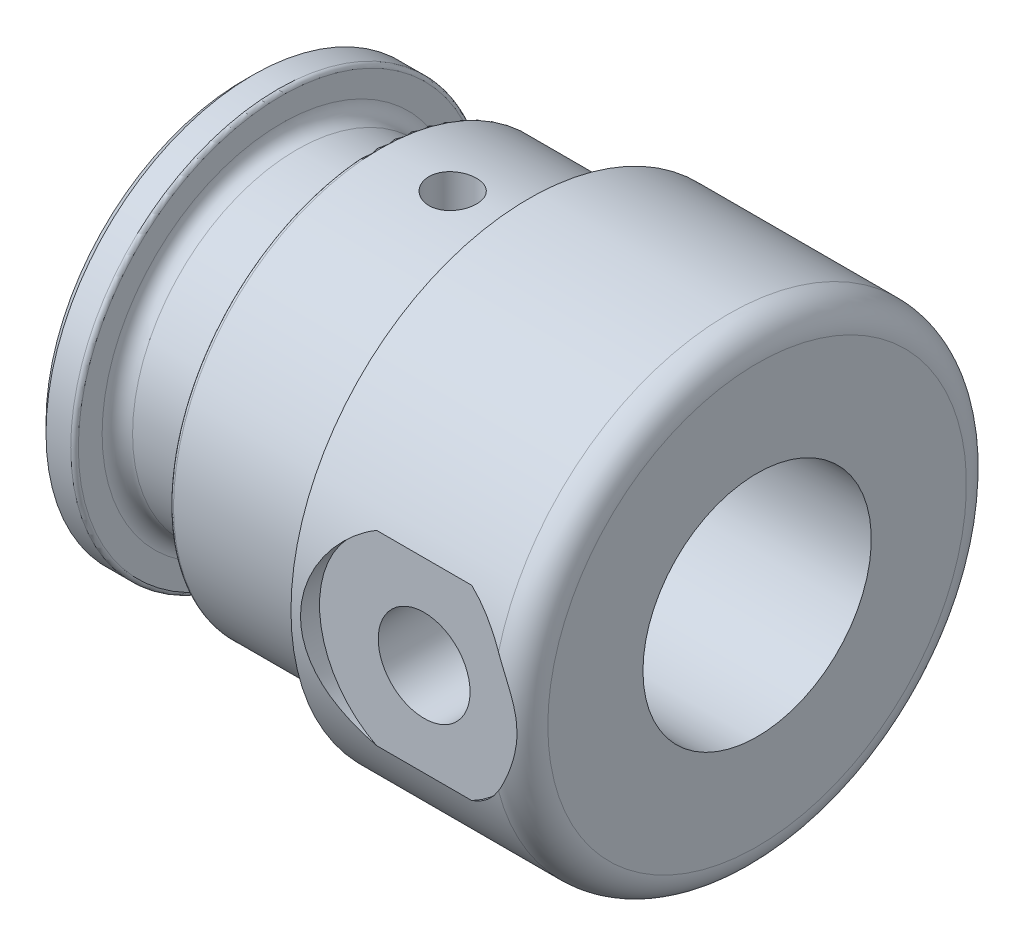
ISO-10303-21;
HEADER;
FILE_DESCRIPTION(('STEP AP214'),'2;1');
FILE_NAME('part.step','',(''),(''),'','','');
FILE_SCHEMA(('AUTOMOTIVE_DESIGN { 1 0 10303 214 1 1 1 1 }'));
ENDSEC;
DATA;
#1=APPLICATION_CONTEXT('core data for automotive mechanical design processes');
#2=APPLICATION_PROTOCOL_DEFINITION('international standard','automotive_design',2000,#1);
#3=PRODUCT_CONTEXT('',#1,'mechanical');
#4=PRODUCT('Part','Part','',(#3));
#5=PRODUCT_RELATED_PRODUCT_CATEGORY('part','',(#4));
#6=PRODUCT_DEFINITION_FORMATION('','',#4);
#7=PRODUCT_DEFINITION_CONTEXT('part definition',#1,'design');
#8=PRODUCT_DEFINITION('design','',#6,#7);
#9=PRODUCT_DEFINITION_SHAPE('','',#8);
#10=(LENGTH_UNIT() NAMED_UNIT(*) SI_UNIT(.MILLI.,.METRE.));
#11=(NAMED_UNIT(*) PLANE_ANGLE_UNIT() SI_UNIT($,.RADIAN.));
#12=(NAMED_UNIT(*) SI_UNIT($,.STERADIAN.) SOLID_ANGLE_UNIT());
#13=UNCERTAINTY_MEASURE_WITH_UNIT(LENGTH_MEASURE(1.E-05),#10,'distance_accuracy_value','');
#14=(GEOMETRIC_REPRESENTATION_CONTEXT(3) GLOBAL_UNCERTAINTY_ASSIGNED_CONTEXT((#13)) GLOBAL_UNIT_ASSIGNED_CONTEXT((#10,
#11,#12)) REPRESENTATION_CONTEXT('',''));
#15=CARTESIAN_POINT('',(0.,0.,0.));
#16=DIRECTION('',(0.,0.,1.));
#17=DIRECTION('',(1.,0.,0.));
#18=AXIS2_PLACEMENT_3D('',#15,#16,#17);
#19=CARTESIAN_POINT('',(0.,0.,0.));
#20=DIRECTION('',(-1.00000000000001,0.,0.));
#21=DIRECTION('',(0.,0.,1.));
#22=AXIS2_PLACEMENT_3D('',#19,#20,#21);
#23=CYLINDRICAL_SURFACE('',#22,10.875);
#24=CARTESIAN_POINT('',(1.8,0.,0.));
#25=DIRECTION('',(-1.00000000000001,0.,0.));
#26=DIRECTION('',(0.,0.,1.));
#27=AXIS2_PLACEMENT_3D('',#24,#25,#26);
#28=CIRCLE('',#27,10.875);
#29=CARTESIAN_POINT('',(1.8,0.,10.875));
#30=VERTEX_POINT('',#29);
#31=EDGE_CURVE('E168',#30,#30,#28,.T.);
#32=ORIENTED_EDGE('',*,*,#31,.T.);
#33=EDGE_LOOP('',(#32));
#34=FACE_BOUND('',#33,.T.);
#35=CARTESIAN_POINT('',(0.5,0.,0.));
#36=DIRECTION('',(1.00000000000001,0.,0.));
#37=DIRECTION('',(0.,0.,-1.));
#38=AXIS2_PLACEMENT_3D('',#35,#36,#37);
#39=CIRCLE('',#38,10.875);
#40=CARTESIAN_POINT('',(0.5,0.,-10.875));
#41=VERTEX_POINT('',#40);
#42=EDGE_CURVE('E171',#41,#41,#39,.T.);
#43=ORIENTED_EDGE('',*,*,#42,.T.);
#44=EDGE_LOOP('',(#43));
#45=FACE_BOUND('',#44,.T.);
#46=ADVANCED_FACE('F40',(#34,#45),#23,.T.);
#47=CARTESIAN_POINT('',(0.,5.55625000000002,0.));
#48=DIRECTION('',(1.00000000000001,0.,0.));
#49=DIRECTION('',(0.,0.,-1.));
#50=AXIS2_PLACEMENT_3D('',#47,#48,#49);
#51=PLANE('',#50);
#52=CARTESIAN_POINT('',(0.,0.,0.));
#53=DIRECTION('',(-1.00000000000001,0.,0.));
#54=DIRECTION('',(0.,0.,1.));
#55=AXIS2_PLACEMENT_3D('',#52,#53,#54);
#56=CIRCLE('',#55,6.);
#57=CARTESIAN_POINT('',(0.,0.,6.));
#58=VERTEX_POINT('',#57);
#59=EDGE_CURVE('E98',#58,#58,#56,.T.);
#60=ORIENTED_EDGE('',*,*,#59,.F.);
#61=EDGE_LOOP('',(#60));
#62=FACE_BOUND('',#61,.T.);
#63=CARTESIAN_POINT('',(0.,0.,0.));
#64=DIRECTION('',(1.00000000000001,0.,0.));
#65=DIRECTION('',(0.,0.,-1.));
#66=AXIS2_PLACEMENT_3D('',#63,#64,#65);
#67=CIRCLE('',#66,10.375);
#68=CARTESIAN_POINT('',(0.,0.,-10.375));
#69=VERTEX_POINT('',#68);
#70=EDGE_CURVE('E174',#69,#69,#67,.F.);
#71=ORIENTED_EDGE('',*,*,#70,.T.);
#72=EDGE_LOOP('',(#71));
#73=FACE_BOUND('',#72,.T.);
#74=ADVANCED_FACE('F158',(#62,#73),#51,.F.);
#75=CARTESIAN_POINT('',(27.0000000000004,12.5000000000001,0.));
#76=DIRECTION('',(-1.00000000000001,0.,0.));
#77=DIRECTION('',(0.,0.,1.));
#78=AXIS2_PLACEMENT_3D('',#75,#76,#77);
#79=PLANE('',#78);
#80=CARTESIAN_POINT('',(27.0000000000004,0.,0.));
#81=DIRECTION('',(-1.00000000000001,0.,0.));
#82=DIRECTION('',(0.,0.,1.));
#83=AXIS2_PLACEMENT_3D('',#80,#81,#82);
#84=CIRCLE('',#83,6.);
#85=CARTESIAN_POINT('',(27.0000000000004,0.,6.));
#86=VERTEX_POINT('',#85);
#87=EDGE_CURVE('E101',#86,#86,#84,.T.);
#88=ORIENTED_EDGE('',*,*,#87,.T.);
#89=EDGE_LOOP('',(#88));
#90=FACE_BOUND('',#89,.T.);
#91=CARTESIAN_POINT('',(27.0000000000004,0.,0.));
#92=DIRECTION('',(-1.00000000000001,0.,0.));
#93=DIRECTION('',(0.,0.,1.));
#94=AXIS2_PLACEMENT_3D('',#91,#92,#93);
#95=CIRCLE('',#94,11.);
#96=CARTESIAN_POINT('',(27.0000000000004,0.,11.));
#97=VERTEX_POINT('',#96);
#98=EDGE_CURVE('E176',#97,#97,#95,.F.);
#99=ORIENTED_EDGE('',*,*,#98,.T.);
#100=EDGE_LOOP('',(#99));
#101=FACE_BOUND('',#100,.T.);
#102=ADVANCED_FACE('F163',(#90,#101),#79,.F.);
#103=CARTESIAN_POINT('',(0.,0.,0.));
#104=DIRECTION('',(-1.00000000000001,0.,0.));
#105=DIRECTION('',(0.,0.,1.));
#106=AXIS2_PLACEMENT_3D('',#103,#104,#105);
#107=CYLINDRICAL_SURFACE('',#106,12.5);
#108=DIRECTION('',(-1.00000000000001,0.,0.));
#109=VECTOR('',#108,1.);
#110=CARTESIAN_POINT('',(0.,4.89897948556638,11.5));
#111=LINE('',#110,#109);
#112=CARTESIAN_POINT('',(23.5000000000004,4.89897948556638,11.5));
#113=VERTEX_POINT('',#112);
#114=CARTESIAN_POINT('',(18.5000000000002,4.89897948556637,11.5));
#115=VERTEX_POINT('',#114);
#116=EDGE_CURVE('E11',#113,#115,#111,.T.);
#117=ORIENTED_EDGE('',*,*,#116,.F.);
#118=CARTESIAN_POINT('',(23.5000000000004,4.89897948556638,11.5));
#119=CARTESIAN_POINT('',(23.6424948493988,4.82626980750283,11.5309719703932));
#120=CARTESIAN_POINT('',(23.7814813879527,4.74750164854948,11.5637153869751));
#121=CARTESIAN_POINT('',(24.0517004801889,4.57848297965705,11.6316723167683));
#122=CARTESIAN_POINT('',(24.1829312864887,4.4882298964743,11.6668863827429));
#123=CARTESIAN_POINT('',(24.4343670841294,4.2987702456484,11.7379984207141));
#124=CARTESIAN_POINT('',(24.5547369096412,4.1997720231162,11.7738697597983));
#125=CARTESIAN_POINT('',(24.7865487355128,3.99202418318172,11.8459201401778));
#126=CARTESIAN_POINT('',(24.8979948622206,3.88327912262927,11.8820990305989));
#127=CARTESIAN_POINT('',(25.0938189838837,3.67526342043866,11.9478992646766));
#128=CARTESIAN_POINT('',(25.1796351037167,3.57737367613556,11.9776209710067));
#129=CARTESIAN_POINT('',(25.3449256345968,3.37473862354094,12.0362944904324));
#130=CARTESIAN_POINT('',(25.4243416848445,3.26994328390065,12.065237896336));
#131=CARTESIAN_POINT('',(25.5000000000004,3.1622776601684,12.0933866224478));
#132=B_SPLINE_CURVE_WITH_KNOTS('',3,(#118,#119,#120,#121,#122,#123,#124,#125,#126,#127,#128,
#129,#130,#131),.UNSPECIFIED.,.F.,.F.,(4,2,2,2,2,2,4),(0.,0.48863502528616,0.977379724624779,
1.45661610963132,1.93562959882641,2.33590420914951,2.73949144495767),.UNSPECIFIED.);
#133=CARTESIAN_POINT('',(25.5000000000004,3.1622776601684,12.0933866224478));
#134=VERTEX_POINT('',#133);
#135=EDGE_CURVE('E75',#113,#134,#132,.T.);
#136=ORIENTED_EDGE('',*,*,#135,.T.);
#137=CARTESIAN_POINT('',(25.5000000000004,0.,0.));
#138=DIRECTION('',(-1.00000000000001,0.,0.));
#139=DIRECTION('',(0.,0.,1.));
#140=AXIS2_PLACEMENT_3D('',#137,#138,#139);
#141=CIRCLE('',#140,12.5);
#142=CARTESIAN_POINT('',(25.5000000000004,-3.1622776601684,12.0933866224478));
#143=VERTEX_POINT('',#142);
#144=EDGE_CURVE('E173',#134,#143,#141,.T.);
#145=ORIENTED_EDGE('',*,*,#144,.T.);
#146=CARTESIAN_POINT('',(25.5000000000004,-3.1622776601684,12.0933866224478));
#147=CARTESIAN_POINT('',(25.4083952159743,-3.29264212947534,12.0593080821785));
#148=CARTESIAN_POINT('',(25.3112708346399,-3.41880304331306,12.0240563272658));
#149=CARTESIAN_POINT('',(25.1066317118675,-3.66208084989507,11.9522044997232));
#150=CARTESIAN_POINT('',(24.9991126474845,-3.77919394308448,11.9156038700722));
#151=CARTESIAN_POINT('',(24.7766156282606,-4.00142680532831,11.8428040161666));
#152=CARTESIAN_POINT('',(24.661825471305,-4.10673684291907,11.8066110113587));
#153=CARTESIAN_POINT('',(24.4236589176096,-4.30729375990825,11.734928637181));
#154=CARTESIAN_POINT('',(24.3002870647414,-4.40254589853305,11.6994389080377));
#155=CARTESIAN_POINT('',(24.0665408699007,-4.56763576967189,11.6358581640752));
#156=CARTESIAN_POINT('',(23.9573653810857,-4.6390769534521,11.6075101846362));
#157=CARTESIAN_POINT('',(23.7329533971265,-4.77475720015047,11.5523630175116));
#158=CARTESIAN_POINT('',(23.6176739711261,-4.83893127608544,11.5255787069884));
#159=CARTESIAN_POINT('',(23.5000000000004,-4.89897948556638,11.5));
#160=B_SPLINE_CURVE_WITH_KNOTS('',3,(#146,#147,#148,#149,#150,#151,#152,#153,#154,#155,#156,
#157,#158,#159),.UNSPECIFIED.,.F.,.F.,(4,2,2,2,2,2,4),(0.,0.488634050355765,0.977472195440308,
1.45671659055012,1.93570913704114,2.33593396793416,2.73949439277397),.UNSPECIFIED.);
#161=CARTESIAN_POINT('',(23.5000000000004,-4.89897948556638,11.5));
#162=VERTEX_POINT('',#161);
#163=EDGE_CURVE('E54',#143,#162,#160,.T.);
#164=ORIENTED_EDGE('',*,*,#163,.T.);
#165=DIRECTION('',(-1.00000000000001,0.,0.));
#166=VECTOR('',#165,1.);
#167=CARTESIAN_POINT('',(0.,-4.89897948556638,11.5));
#168=LINE('',#167,#166);
#169=CARTESIAN_POINT('',(18.5000000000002,-4.8989794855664,11.5));
#170=VERTEX_POINT('',#169);
#171=EDGE_CURVE('E47',#170,#162,#168,.F.);
#172=ORIENTED_EDGE('',*,*,#171,.F.);
#173=CARTESIAN_POINT('',(18.5000000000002,-4.8989794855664,11.5));
#174=CARTESIAN_POINT('',(18.3589289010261,-4.82698356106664,11.5306652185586));
#175=CARTESIAN_POINT('',(18.2213464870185,-4.74909801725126,11.5630505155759));
#176=CARTESIAN_POINT('',(17.9538314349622,-4.5821102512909,11.6302362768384));
#177=CARTESIAN_POINT('',(17.8238969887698,-4.49301069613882,11.6650361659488));
#178=CARTESIAN_POINT('',(17.4464386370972,-4.20965109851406,11.7715548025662));
#179=CARTESIAN_POINT('',(17.2113014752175,-3.99935156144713,11.8453829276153));
#180=CARTESIAN_POINT('',(16.7799521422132,-3.54120421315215,11.9903049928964));
#181=CARTESIAN_POINT('',(16.5837363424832,-3.2933599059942,12.0613991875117));
#182=CARTESIAN_POINT('',(16.3227592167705,-2.89800310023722,12.1601870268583));
#183=CARTESIAN_POINT('',(16.2413055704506,-2.76224240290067,12.1918155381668));
#184=CARTESIAN_POINT('',(16.0901456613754,-2.48362880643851,12.25160556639));
#185=CARTESIAN_POINT('',(16.020434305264,-2.34077901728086,12.2797685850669));
#186=CARTESIAN_POINT('',(15.8944336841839,-2.05127274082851,12.3314054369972));
#187=CARTESIAN_POINT('',(15.8379464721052,-1.90471451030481,12.3549474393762));
#188=CARTESIAN_POINT('',(15.737576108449,-1.6067339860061,12.3972187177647));
#189=CARTESIAN_POINT('',(15.693687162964,-1.45531396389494,12.4159502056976));
#190=CARTESIAN_POINT('',(15.6189901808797,-1.14874718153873,12.4480572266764));
#191=CARTESIAN_POINT('',(15.5881799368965,-0.993601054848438,12.4614336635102));
#192=CARTESIAN_POINT('',(15.5400122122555,-0.680852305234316,12.4824274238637));
#193=CARTESIAN_POINT('',(15.5226536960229,-0.523249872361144,12.4900451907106));
#194=CARTESIAN_POINT('',(15.5024486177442,-0.219568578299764,12.4989199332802));
#195=CARTESIAN_POINT('',(15.4985563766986,-0.0735716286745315,12.5006351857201));
#196=CARTESIAN_POINT('',(15.502395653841,0.218291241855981,12.4989459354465));
#197=CARTESIAN_POINT('',(15.5101310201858,0.364157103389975,12.495539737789));
#198=CARTESIAN_POINT('',(15.5371395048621,0.654526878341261,12.4836972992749));
#199=CARTESIAN_POINT('',(15.5564063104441,0.799031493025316,12.4752638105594));
#200=CARTESIAN_POINT('',(15.6062705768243,1.08575702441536,12.4535863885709));
#201=CARTESIAN_POINT('',(15.636872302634,1.22797706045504,12.4403406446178));
#202=CARTESIAN_POINT('',(15.7081985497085,1.50560997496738,12.4097602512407));
#203=CARTESIAN_POINT('',(15.7486534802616,1.64110420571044,12.3925350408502));
#204=CARTESIAN_POINT('',(15.8396680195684,1.90811413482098,12.3542435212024));
#205=CARTESIAN_POINT('',(15.890231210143,2.03962840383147,12.3331758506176));
#206=CARTESIAN_POINT('',(16.0564828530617,2.42703027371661,12.2649118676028));
#207=CARTESIAN_POINT('',(16.1867739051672,2.67593311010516,12.212636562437));
#208=CARTESIAN_POINT('',(16.4913463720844,3.16383248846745,12.0957442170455));
#209=CARTESIAN_POINT('',(16.6678127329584,3.40131804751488,12.0305717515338));
#210=CARTESIAN_POINT('',(17.0557482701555,3.84440880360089,11.896388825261));
#211=CARTESIAN_POINT('',(17.2672041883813,4.05002601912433,11.8273798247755));
#212=CARTESIAN_POINT('',(17.6484574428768,4.36548662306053,11.713713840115));
#213=CARTESIAN_POINT('',(17.8101311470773,4.48499785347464,11.6682888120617));
#214=CARTESIAN_POINT('',(18.14599432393,4.70584437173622,11.5809782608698));
#215=CARTESIAN_POINT('',(18.3201663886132,4.80720427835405,11.5390879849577));
#216=CARTESIAN_POINT('',(18.5000000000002,4.89897948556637,11.5));
#217=B_SPLINE_CURVE_WITH_KNOTS('',3,(#173,#174,#175,#176,#177,#178,#179,#180,#181,#182,#183,
#184,#185,#186,#187,#188,#189,#190,#191,#192,#193,#194,#195,#196,#197,#198,#199,#200,#201,#202,
#203,#204,#205,#206,#207,#208,#209,#210,#211,#212,#213,#214,#215,#216),.UNSPECIFIED.,.F.,.F.,(4,
2,2,2,2,2,2,2,2,2,2,2,2,2,2,2,2,2,2,2,2,4),(0.,0.483637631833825,0.967160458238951,
1.93434797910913,2.90144528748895,3.38527842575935,3.86890115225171,4.344740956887,
4.82036157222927,5.29590188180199,5.77140557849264,6.20903838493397,6.64681605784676,
7.08435429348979,7.52205732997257,7.94891570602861,8.37592560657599,9.22946393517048,
10.1346542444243,11.0395023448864,11.6567277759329,12.2731096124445),.UNSPECIFIED.);
#218=EDGE_CURVE('E96',#170,#115,#217,.T.);
#219=ORIENTED_EDGE('',*,*,#218,.T.);
#220=EDGE_LOOP('',(#117,#136,#145,#164,#172,#219));
#221=FACE_BOUND('',#220,.T.);
#222=CARTESIAN_POINT('',(15.0000000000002,0.,0.));
#223=DIRECTION('',(-1.00000000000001,0.,0.));
#224=DIRECTION('',(0.,0.,1.));
#225=AXIS2_PLACEMENT_3D('',#222,#223,#224);
#226=CIRCLE('',#225,12.5);
#227=CARTESIAN_POINT('',(15.0000000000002,0.,12.5));
#228=VERTEX_POINT('',#227);
#229=EDGE_CURVE('E179',#228,#228,#226,.T.);
#230=ORIENTED_EDGE('',*,*,#229,.F.);
#231=EDGE_LOOP('',(#230));
#232=FACE_BOUND('',#231,.T.);
#233=ADVANCED_FACE('F94',(#221,#232),#107,.T.);
#234=CARTESIAN_POINT('',(15.0000000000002,10.875,0.));
#235=DIRECTION('',(1.00000000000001,0.,0.));
#236=DIRECTION('',(0.,0.,-1.));
#237=AXIS2_PLACEMENT_3D('',#234,#235,#236);
#238=PLANE('',#237);
#239=CARTESIAN_POINT('',(15.0000000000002,0.,0.));
#240=DIRECTION('',(-1.00000000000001,0.,0.));
#241=DIRECTION('',(0.,0.,1.));
#242=AXIS2_PLACEMENT_3D('',#239,#240,#241);
#243=CIRCLE('',#242,10.875);
#244=CARTESIAN_POINT('',(15.0000000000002,0.,10.875));
#245=VERTEX_POINT('',#244);
#246=EDGE_CURVE('E190',#245,#245,#243,.T.);
#247=ORIENTED_EDGE('',*,*,#246,.F.);
#248=EDGE_LOOP('',(#247));
#249=FACE_BOUND('',#248,.T.);
#250=ORIENTED_EDGE('',*,*,#229,.T.);
#251=EDGE_LOOP('',(#250));
#252=FACE_BOUND('',#251,.T.);
#253=ADVANCED_FACE('F219',(#249,#252),#238,.F.);
#254=CARTESIAN_POINT('',(0.,0.,0.));
#255=DIRECTION('',(-1.00000000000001,0.,0.));
#256=DIRECTION('',(0.,0.,1.));
#257=AXIS2_PLACEMENT_3D('',#254,#255,#256);
#258=CYLINDRICAL_SURFACE('',#257,10.875);
#259=CARTESIAN_POINT('',(11.0000000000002,-10.8029220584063,-1.25000000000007));
#260=CARTESIAN_POINT('',(10.9300362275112,-10.8029229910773,-1.24999699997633));
#261=CARTESIAN_POINT('',(10.8600276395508,-10.8036090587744,-1.24410628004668));
#262=CARTESIAN_POINT('',(10.7219556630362,-10.8062784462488,-1.22069838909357));
#263=CARTESIAN_POINT('',(10.6538944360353,-10.8082631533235,-1.2031687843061));
#264=CARTESIAN_POINT('',(10.5217364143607,-10.8133021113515,-1.15700398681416));
#265=CARTESIAN_POINT('',(10.457637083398,-10.8163556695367,-1.12837598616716));
#266=CARTESIAN_POINT('',(10.335165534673,-10.8231874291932,-1.06084179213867));
#267=CARTESIAN_POINT('',(10.2767922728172,-10.8269654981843,-1.0219374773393));
#268=CARTESIAN_POINT('',(10.1671395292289,-10.8348407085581,-0.934756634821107));
#269=CARTESIAN_POINT('',(10.1158911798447,-10.838939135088,-0.886441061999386));
#270=CARTESIAN_POINT('',(10.0222115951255,-10.8469816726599,-0.781893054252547));
#271=CARTESIAN_POINT('',(9.97978078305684,-10.8509257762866,-0.725660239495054));
#272=CARTESIAN_POINT('',(9.90483057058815,-10.8582282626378,-0.606680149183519));
#273=CARTESIAN_POINT('',(9.87233911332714,-10.8615849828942,-0.543915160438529));
#274=CARTESIAN_POINT('',(9.81836880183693,-10.8673204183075,-0.413774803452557));
#275=CARTESIAN_POINT('',(9.79688959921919,-10.8696991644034,-0.3463995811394));
#276=CARTESIAN_POINT('',(9.76564589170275,-10.8732015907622,-0.209268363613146));
#277=CARTESIAN_POINT('',(9.7558298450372,-10.8743307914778,-0.139524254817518));
#278=CARTESIAN_POINT('',(9.74803146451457,-10.8752257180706,0.000629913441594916));
#279=CARTESIAN_POINT('',(9.75004873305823,-10.874991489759,0.0710399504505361));
#280=CARTESIAN_POINT('',(9.7658181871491,-10.8731904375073,0.210176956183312));
#281=CARTESIAN_POINT('',(9.77951494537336,-10.871629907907,0.278910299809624));
#282=CARTESIAN_POINT('',(9.81816806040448,-10.8673587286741,0.413096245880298));
#283=CARTESIAN_POINT('',(9.84312460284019,-10.8646480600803,0.478548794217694));
#284=CARTESIAN_POINT('',(9.90364858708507,-10.8583704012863,0.604488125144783));
#285=CARTESIAN_POINT('',(9.93924024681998,-10.8548014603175,0.664963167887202));
#286=CARTESIAN_POINT('',(10.0200065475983,-10.8472070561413,0.779102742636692));
#287=CARTESIAN_POINT('',(10.0651815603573,-10.8431815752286,0.832767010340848));
#288=CARTESIAN_POINT('',(10.1641432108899,-10.8350976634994,0.932086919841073));
#289=CARTESIAN_POINT('',(10.21797811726,-10.8310391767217,0.977694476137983));
#290=CARTESIAN_POINT('',(10.3325649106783,-10.8233697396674,1.05923323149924));
#291=CARTESIAN_POINT('',(10.3933168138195,-10.819758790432,1.09516440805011));
#292=CARTESIAN_POINT('',(10.5200533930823,-10.8133931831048,1.15633191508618));
#293=CARTESIAN_POINT('',(10.5860397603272,-10.8106388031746,1.18156477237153));
#294=CARTESIAN_POINT('',(10.7213516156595,-10.8063037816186,1.22057870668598));
#295=CARTESIAN_POINT('',(10.790676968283,-10.8047230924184,1.23436024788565));
#296=CARTESIAN_POINT('',(10.9302753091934,-10.8029229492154,1.25001744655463));
#297=CARTESIAN_POINT('',(11.000540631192,-10.8026957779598,1.25196060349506));
#298=CARTESIAN_POINT('',(11.1403958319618,-10.8036080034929,1.24406361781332));
#299=CARTESIAN_POINT('',(11.2099857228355,-10.8047473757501,1.23422368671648));
#300=CARTESIAN_POINT('',(11.346314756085,-10.8082572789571,1.20309652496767));
#301=CARTESIAN_POINT('',(11.4130613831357,-10.8106243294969,1.18184164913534));
#302=CARTESIAN_POINT('',(11.5420427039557,-10.8163200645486,1.12852113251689));
#303=CARTESIAN_POINT('',(11.604277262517,-10.8196487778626,1.09645516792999));
#304=CARTESIAN_POINT('',(11.7227742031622,-10.8269113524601,1.02225540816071));
#305=CARTESIAN_POINT('',(11.779008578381,-10.8308478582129,0.980077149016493));
#306=CARTESIAN_POINT('',(11.883623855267,-10.8388740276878,0.886913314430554));
#307=CARTESIAN_POINT('',(11.9320044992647,-10.8429636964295,0.835927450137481));
#308=CARTESIAN_POINT('',(12.0197742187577,-10.850858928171,0.726301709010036));
#309=CARTESIAN_POINT('',(12.0591190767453,-10.8546630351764,0.667626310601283));
#310=CARTESIAN_POINT('',(12.1273951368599,-10.8615370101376,0.54446097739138));
#311=CARTESIAN_POINT('',(12.1563265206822,-10.8646068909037,0.479971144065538));
#312=CARTESIAN_POINT('',(12.2028805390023,-10.8696600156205,0.3471576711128));
#313=CARTESIAN_POINT('',(12.2205292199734,-10.8716457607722,0.278843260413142));
#314=CARTESIAN_POINT('',(12.2441017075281,-10.8743172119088,0.140196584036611));
#315=CARTESIAN_POINT('',(12.2500259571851,-10.875002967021,0.0698643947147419));
#316=CARTESIAN_POINT('',(12.2499740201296,-10.8749970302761,-0.0703885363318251));
#317=CARTESIAN_POINT('',(12.244066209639,-10.8743132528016,-0.140309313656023));
#318=CARTESIAN_POINT('',(12.2206620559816,-10.8716607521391,-0.278157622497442));
#319=CARTESIAN_POINT('',(12.2031657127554,-10.8696920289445,-0.346085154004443));
#320=CARTESIAN_POINT('',(12.1571015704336,-10.8646899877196,-0.478013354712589));
#321=CARTESIAN_POINT('',(12.1285365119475,-10.8616569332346,-0.542014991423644));
#322=CARTESIAN_POINT('',(12.0611529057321,-10.8548630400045,-0.664326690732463));
#323=CARTESIAN_POINT('',(12.0223343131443,-10.8511021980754,-0.722636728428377));
#324=CARTESIAN_POINT('',(11.9352908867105,-10.8432472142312,-0.832259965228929));
#325=CARTESIAN_POINT('',(11.8870151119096,-10.8391513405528,-0.883532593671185));
#326=CARTESIAN_POINT('',(11.7825319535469,-10.831102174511,-0.977277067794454));
#327=CARTESIAN_POINT('',(11.7263226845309,-10.8271489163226,-1.01974681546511));
#328=CARTESIAN_POINT('',(11.6073597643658,-10.8198187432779,-1.09479596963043));
#329=CARTESIAN_POINT('',(11.5445852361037,-10.8164437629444,-1.12734245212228));
#330=CARTESIAN_POINT('',(11.4144602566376,-10.8106750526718,-1.18138701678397));
#331=CARTESIAN_POINT('',(11.3471149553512,-10.8082802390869,-1.20289730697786));
#332=CARTESIAN_POINT('',(11.2328388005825,-10.805334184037,-1.22901672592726));
#333=CARTESIAN_POINT('',(11.1866332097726,-10.804434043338,-1.2368743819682));
#334=CARTESIAN_POINT('',(11.0936251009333,-10.8032276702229,-1.24736700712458));
#335=CARTESIAN_POINT('',(11.0468225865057,-10.8029214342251,-1.2500020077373));
#336=CARTESIAN_POINT('',(11.0000000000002,-10.8029220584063,-1.25000000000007));
#337=B_SPLINE_CURVE_WITH_KNOTS('',3,(#259,#260,#261,#262,#263,#264,#265,#266,#267,#268,#269,
#270,#271,#272,#273,#274,#275,#276,#277,#278,#279,#280,#281,#282,#283,#284,#285,#286,#287,#288,
#289,#290,#291,#292,#293,#294,#295,#296,#297,#298,#299,#300,#301,#302,#303,#304,#305,#306,#307,
#308,#309,#310,#311,#312,#313,#314,#315,#316,#317,#318,#319,#320,#321,#322,#323,#324,#325,#326,
#327,#328,#329,#330,#331,#332,#333,#334,#335,#336),.UNSPECIFIED.,.T.,.F.,(4,2,2,2,2,2,2,2,2,2,2,
2,2,2,2,2,2,2,2,2,2,2,2,2,2,2,2,2,2,2,2,2,2,2,2,2,2,2,4),(0.,0.209720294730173,
0.419664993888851,0.629473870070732,0.839244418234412,1.04990454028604,1.26057477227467,
1.47183194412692,1.68308243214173,1.89339584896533,2.10370219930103,2.31301601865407,
2.52233328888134,2.73213088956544,2.94193662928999,3.1529551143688,3.36397409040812,
3.57506152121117,3.78614039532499,3.99601461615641,4.20588506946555,4.41516377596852,
4.62444875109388,4.83467140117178,5.04490094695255,5.25613833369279,5.46737203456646,
5.67811631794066,5.88885263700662,6.09837464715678,6.30789665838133,6.51736682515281,
6.72683790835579,6.93746996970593,7.14815217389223,7.35952597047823,7.57066544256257,
7.71101959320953,7.85137289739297),.UNSPECIFIED.);
#338=CARTESIAN_POINT('',(11.0000000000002,-10.8029220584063,-1.25000000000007));
#339=VERTEX_POINT('',#338);
#340=EDGE_CURVE('E276',#339,#339,#337,.T.);
#341=ORIENTED_EDGE('',*,*,#340,.T.);
#342=EDGE_LOOP('',(#341));
#343=FACE_BOUND('',#342,.T.);
#344=CARTESIAN_POINT('',(7.20000000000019,0.,0.));
#345=DIRECTION('',(1.00000000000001,0.,0.));
#346=DIRECTION('',(0.,0.,-1.));
#347=AXIS2_PLACEMENT_3D('',#344,#345,#346);
#348=CIRCLE('',#347,10.875);
#349=CARTESIAN_POINT('',(7.20000000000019,0.,-10.875));
#350=VERTEX_POINT('',#349);
#351=EDGE_CURVE('E243',#350,#350,#348,.T.);
#352=ORIENTED_EDGE('',*,*,#351,.T.);
#353=EDGE_LOOP('',(#352));
#354=FACE_BOUND('',#353,.T.);
#355=CARTESIAN_POINT('',(11.0000000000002,10.8029220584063,1.24999999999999));
#356=CARTESIAN_POINT('',(10.9300362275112,10.8029229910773,1.24999699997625));
#357=CARTESIAN_POINT('',(10.8600276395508,10.8036090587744,1.24410628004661));
#358=CARTESIAN_POINT('',(10.7219556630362,10.8062784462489,1.2206983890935));
#359=CARTESIAN_POINT('',(10.6538944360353,10.8082631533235,1.20316878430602));
#360=CARTESIAN_POINT('',(10.5217364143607,10.8133021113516,1.15700398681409));
#361=CARTESIAN_POINT('',(10.457637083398,10.8163556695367,1.12837598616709));
#362=CARTESIAN_POINT('',(10.335165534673,10.8231874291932,1.06084179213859));
#363=CARTESIAN_POINT('',(10.2767922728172,10.8269654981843,1.02193747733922));
#364=CARTESIAN_POINT('',(10.1671395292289,10.8348407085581,0.934756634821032));
#365=CARTESIAN_POINT('',(10.1158911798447,10.838939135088,0.88644106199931));
#366=CARTESIAN_POINT('',(10.0222115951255,10.8469816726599,0.781893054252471));
#367=CARTESIAN_POINT('',(9.97978078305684,10.8509257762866,0.725660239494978));
#368=CARTESIAN_POINT('',(9.90483057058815,10.8582282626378,0.606680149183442));
#369=CARTESIAN_POINT('',(9.87233911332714,10.8615849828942,0.543915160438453));
#370=CARTESIAN_POINT('',(9.81836880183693,10.8673204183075,0.41377480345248));
#371=CARTESIAN_POINT('',(9.79688959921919,10.8696991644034,0.346399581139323));
#372=CARTESIAN_POINT('',(9.76564589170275,10.8732015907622,0.209268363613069));
#373=CARTESIAN_POINT('',(9.7558298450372,10.8743307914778,0.139524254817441));
#374=CARTESIAN_POINT('',(9.74803146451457,10.8752257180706,-0.00062991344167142));
#375=CARTESIAN_POINT('',(9.75004873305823,10.874991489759,-0.0710399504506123));
#376=CARTESIAN_POINT('',(9.7658181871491,10.8731904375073,-0.210176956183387));
#377=CARTESIAN_POINT('',(9.77951494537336,10.871629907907,-0.2789102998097));
#378=CARTESIAN_POINT('',(9.81816806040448,10.8673587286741,-0.413096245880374));
#379=CARTESIAN_POINT('',(9.84312460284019,10.8646480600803,-0.47854879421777));
#380=CARTESIAN_POINT('',(9.90364858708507,10.8583704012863,-0.604488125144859));
#381=CARTESIAN_POINT('',(9.93924024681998,10.8548014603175,-0.664963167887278));
#382=CARTESIAN_POINT('',(10.0200065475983,10.8472070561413,-0.779102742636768));
#383=CARTESIAN_POINT('',(10.0651815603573,10.8431815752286,-0.832767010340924));
#384=CARTESIAN_POINT('',(10.1641432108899,10.8350976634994,-0.932086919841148));
#385=CARTESIAN_POINT('',(10.21797811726,10.8310391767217,-0.977694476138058));
#386=CARTESIAN_POINT('',(10.3325649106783,10.8233697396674,-1.05923323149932));
#387=CARTESIAN_POINT('',(10.3933168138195,10.819758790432,-1.09516440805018));
#388=CARTESIAN_POINT('',(10.5200533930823,10.8133931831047,-1.15633191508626));
#389=CARTESIAN_POINT('',(10.5860397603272,10.8106388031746,-1.18156477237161));
#390=CARTESIAN_POINT('',(10.7213516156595,10.8063037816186,-1.22057870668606));
#391=CARTESIAN_POINT('',(10.790676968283,10.8047230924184,-1.23436024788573));
#392=CARTESIAN_POINT('',(10.9302753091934,10.8029229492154,-1.25001744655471));
#393=CARTESIAN_POINT('',(11.000540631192,10.8026957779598,-1.25196060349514));
#394=CARTESIAN_POINT('',(11.1403958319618,10.8036080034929,-1.2440636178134));
#395=CARTESIAN_POINT('',(11.2099857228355,10.8047473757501,-1.23422368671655));
#396=CARTESIAN_POINT('',(11.346314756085,10.8082572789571,-1.20309652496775));
#397=CARTESIAN_POINT('',(11.4130613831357,10.8106243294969,-1.18184164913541));
#398=CARTESIAN_POINT('',(11.5420427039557,10.8163200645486,-1.12852113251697));
#399=CARTESIAN_POINT('',(11.604277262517,10.8196487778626,-1.09645516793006));
#400=CARTESIAN_POINT('',(11.7227742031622,10.8269113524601,-1.02225540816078));
#401=CARTESIAN_POINT('',(11.779008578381,10.8308478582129,-0.980077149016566));
#402=CARTESIAN_POINT('',(11.883623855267,10.8388740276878,-0.886913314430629));
#403=CARTESIAN_POINT('',(11.9320044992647,10.8429636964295,-0.835927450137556));
#404=CARTESIAN_POINT('',(12.0197742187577,10.850858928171,-0.726301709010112));
#405=CARTESIAN_POINT('',(12.0591190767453,10.8546630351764,-0.66762631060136));
#406=CARTESIAN_POINT('',(12.1273951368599,10.8615370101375,-0.544460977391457));
#407=CARTESIAN_POINT('',(12.1563265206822,10.8646068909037,-0.479971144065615));
#408=CARTESIAN_POINT('',(12.2028805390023,10.8696600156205,-0.347157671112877));
#409=CARTESIAN_POINT('',(12.2205292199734,10.8716457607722,-0.278843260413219));
#410=CARTESIAN_POINT('',(12.2441017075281,10.8743172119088,-0.140196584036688));
#411=CARTESIAN_POINT('',(12.2500259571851,10.875002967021,-0.0698643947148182));
#412=CARTESIAN_POINT('',(12.2499740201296,10.8749970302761,0.0703885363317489));
#413=CARTESIAN_POINT('',(12.244066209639,10.8743132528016,0.140309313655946));
#414=CARTESIAN_POINT('',(12.2206620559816,10.8716607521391,0.278157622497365));
#415=CARTESIAN_POINT('',(12.2031657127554,10.8696920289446,0.346085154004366));
#416=CARTESIAN_POINT('',(12.1571015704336,10.8646899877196,0.478013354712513));
#417=CARTESIAN_POINT('',(12.1285365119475,10.8616569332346,0.542014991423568));
#418=CARTESIAN_POINT('',(12.0611529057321,10.8548630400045,0.664326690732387));
#419=CARTESIAN_POINT('',(12.0223343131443,10.8511021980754,0.722636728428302));
#420=CARTESIAN_POINT('',(11.9352908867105,10.8432472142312,0.832259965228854));
#421=CARTESIAN_POINT('',(11.8870151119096,10.8391513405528,0.883532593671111));
#422=CARTESIAN_POINT('',(11.7825319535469,10.831102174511,0.977277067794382));
#423=CARTESIAN_POINT('',(11.7263226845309,10.8271489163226,1.01974681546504));
#424=CARTESIAN_POINT('',(11.6073597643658,10.8198187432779,1.09479596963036));
#425=CARTESIAN_POINT('',(11.5445852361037,10.8164437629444,1.12734245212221));
#426=CARTESIAN_POINT('',(11.4144602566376,10.8106750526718,1.18138701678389));
#427=CARTESIAN_POINT('',(11.3471149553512,10.8082802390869,1.20289730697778));
#428=CARTESIAN_POINT('',(11.2328388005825,10.805334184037,1.22901672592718));
#429=CARTESIAN_POINT('',(11.1866332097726,10.804434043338,1.23687438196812));
#430=CARTESIAN_POINT('',(11.0936251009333,10.8032276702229,1.24736700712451));
#431=CARTESIAN_POINT('',(11.0468225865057,10.8029214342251,1.25000200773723));
#432=CARTESIAN_POINT('',(11.0000000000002,10.8029220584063,1.24999999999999));
#433=B_SPLINE_CURVE_WITH_KNOTS('',3,(#355,#356,#357,#358,#359,#360,#361,#362,#363,#364,#365,
#366,#367,#368,#369,#370,#371,#372,#373,#374,#375,#376,#377,#378,#379,#380,#381,#382,#383,#384,
#385,#386,#387,#388,#389,#390,#391,#392,#393,#394,#395,#396,#397,#398,#399,#400,#401,#402,#403,
#404,#405,#406,#407,#408,#409,#410,#411,#412,#413,#414,#415,#416,#417,#418,#419,#420,#421,#422,
#423,#424,#425,#426,#427,#428,#429,#430,#431,#432),.UNSPECIFIED.,.T.,.F.,(4,2,2,2,2,2,2,2,2,2,2,
2,2,2,2,2,2,2,2,2,2,2,2,2,2,2,2,2,2,2,2,2,2,2,2,2,2,2,4),(0.,0.209720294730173,
0.419664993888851,0.629473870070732,0.839244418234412,1.04990454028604,1.26057477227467,
1.47183194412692,1.68308243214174,1.89339584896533,2.10370219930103,2.31301601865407,
2.52233328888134,2.73213088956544,2.94193662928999,3.15295511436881,3.36397409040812,
3.57506152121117,3.78614039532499,3.99601461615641,4.20588506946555,4.41516377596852,
4.62444875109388,4.83467140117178,5.04490094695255,5.25613833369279,5.46737203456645,
5.67811631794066,5.88885263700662,6.09837464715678,6.30789665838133,6.51736682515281,
6.72683790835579,6.93746996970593,7.14815217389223,7.35952597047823,7.57066544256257,
7.71101959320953,7.85137289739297),.UNSPECIFIED.);
#434=CARTESIAN_POINT('',(11.0000000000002,10.8029220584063,1.24999999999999));
#435=VERTEX_POINT('',#434);
#436=EDGE_CURVE('E183',#435,#435,#433,.T.);
#437=ORIENTED_EDGE('',*,*,#436,.T.);
#438=EDGE_LOOP('',(#437));
#439=FACE_BOUND('',#438,.T.);
#440=ORIENTED_EDGE('',*,*,#246,.T.);
#441=EDGE_LOOP('',(#440));
#442=FACE_BOUND('',#441,.T.);
#443=ADVANCED_FACE('F193',(#343,#354,#439,#442),#258,.T.);
#444=CARTESIAN_POINT('',(7.0000000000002,8.62500000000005,0.));
#445=DIRECTION('',(1.00000000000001,0.,0.));
#446=DIRECTION('',(0.,0.,-1.));
#447=AXIS2_PLACEMENT_3D('',#444,#445,#446);
#448=PLANE('',#447);
#449=CARTESIAN_POINT('',(7.0000000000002,0.,0.));
#450=DIRECTION('',(1.00000000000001,0.,0.));
#451=DIRECTION('',(0.,0.,-1.));
#452=AXIS2_PLACEMENT_3D('',#449,#450,#451);
#453=CIRCLE('',#452,10.675);
#454=CARTESIAN_POINT('',(7.0000000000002,0.,-10.675));
#455=VERTEX_POINT('',#454);
#456=EDGE_CURVE('E224',#455,#455,#453,.F.);
#457=ORIENTED_EDGE('',*,*,#456,.T.);
#458=EDGE_LOOP('',(#457));
#459=FACE_BOUND('',#458,.T.);
#460=CARTESIAN_POINT('',(7.0000000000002,0.,0.));
#461=DIRECTION('',(1.00000000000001,0.,0.));
#462=DIRECTION('',(0.,0.,-1.));
#463=AXIS2_PLACEMENT_3D('',#460,#461,#462);
#464=CIRCLE('',#463,9.425);
#465=CARTESIAN_POINT('',(7.0000000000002,0.,-9.425));
#466=VERTEX_POINT('',#465);
#467=EDGE_CURVE('E227',#466,#466,#464,.T.);
#468=ORIENTED_EDGE('',*,*,#467,.T.);
#469=EDGE_LOOP('',(#468));
#470=FACE_BOUND('',#469,.T.);
#471=ADVANCED_FACE('F212',(#459,#470),#448,.F.);
#472=CARTESIAN_POINT('',(0.,0.,0.));
#473=DIRECTION('',(-1.00000000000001,0.,0.));
#474=DIRECTION('',(0.,0.,1.));
#475=AXIS2_PLACEMENT_3D('',#472,#473,#474);
#476=CYLINDRICAL_SURFACE('',#475,8.625);
#477=CARTESIAN_POINT('',(6.20000000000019,0.,0.));
#478=DIRECTION('',(1.00000000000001,0.,0.));
#479=DIRECTION('',(0.,0.,-1.));
#480=AXIS2_PLACEMENT_3D('',#477,#478,#479);
#481=CIRCLE('',#480,8.625);
#482=CARTESIAN_POINT('',(6.20000000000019,0.,-8.625));
#483=VERTEX_POINT('',#482);
#484=EDGE_CURVE('E230',#483,#483,#481,.F.);
#485=ORIENTED_EDGE('',*,*,#484,.T.);
#486=EDGE_LOOP('',(#485));
#487=FACE_BOUND('',#486,.T.);
#488=CARTESIAN_POINT('',(2.8,0.,0.));
#489=DIRECTION('',(-1.00000000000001,0.,0.));
#490=DIRECTION('',(0.,0.,1.));
#491=AXIS2_PLACEMENT_3D('',#488,#489,#490);
#492=CIRCLE('',#491,8.625);
#493=CARTESIAN_POINT('',(2.8,0.,8.625));
#494=VERTEX_POINT('',#493);
#495=EDGE_CURVE('E235',#494,#494,#492,.F.);
#496=ORIENTED_EDGE('',*,*,#495,.T.);
#497=EDGE_LOOP('',(#496));
#498=FACE_BOUND('',#497,.T.);
#499=ADVANCED_FACE('F209',(#487,#498),#476,.T.);
#500=CARTESIAN_POINT('',(2.,10.875,0.));
#501=DIRECTION('',(-1.00000000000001,0.,0.));
#502=DIRECTION('',(0.,0.,1.));
#503=AXIS2_PLACEMENT_3D('',#500,#501,#502);
#504=PLANE('',#503);
#505=CARTESIAN_POINT('',(2.,0.,0.));
#506=DIRECTION('',(-1.00000000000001,0.,0.));
#507=DIRECTION('',(0.,0.,1.));
#508=AXIS2_PLACEMENT_3D('',#505,#506,#507);
#509=CIRCLE('',#508,10.675);
#510=CARTESIAN_POINT('',(2.,0.,10.675));
#511=VERTEX_POINT('',#510);
#512=EDGE_CURVE('E240',#511,#511,#509,.F.);
#513=ORIENTED_EDGE('',*,*,#512,.T.);
#514=EDGE_LOOP('',(#513));
#515=FACE_BOUND('',#514,.T.);
#516=CARTESIAN_POINT('',(2.,0.,0.));
#517=DIRECTION('',(-1.00000000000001,0.,0.));
#518=DIRECTION('',(0.,0.,1.));
#519=AXIS2_PLACEMENT_3D('',#516,#517,#518);
#520=CIRCLE('',#519,9.425);
#521=CARTESIAN_POINT('',(2.,0.,9.425));
#522=VERTEX_POINT('',#521);
#523=EDGE_CURVE('E229',#522,#522,#520,.T.);
#524=ORIENTED_EDGE('',*,*,#523,.T.);
#525=EDGE_LOOP('',(#524));
#526=FACE_BOUND('',#525,.T.);
#527=ADVANCED_FACE('F206',(#515,#526),#504,.F.);
#528=CARTESIAN_POINT('',(0.,0.,0.));
#529=DIRECTION('',(1.00000000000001,0.,0.));
#530=DIRECTION('',(0.,0.,-1.));
#531=AXIS2_PLACEMENT_3D('',#528,#529,#530);
#532=CONICAL_SURFACE('',#531,10.375,0.785398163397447);
#533=ORIENTED_EDGE('',*,*,#42,.F.);
#534=EDGE_LOOP('',(#533));
#535=FACE_BOUND('',#534,.T.);
#536=ORIENTED_EDGE('',*,*,#70,.F.);
#537=EDGE_LOOP('',(#536));
#538=FACE_BOUND('',#537,.T.);
#539=ADVANCED_FACE('F202',(#535,#538),#532,.T.);
#540=CARTESIAN_POINT('',(11.0000000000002,11.125,0.));
#541=DIRECTION('',(0.,1.00000000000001,0.));
#542=DIRECTION('',(0.,0.,1.));
#543=AXIS2_PLACEMENT_3D('',#540,#541,#542);
#544=CYLINDRICAL_SURFACE('',#543,1.24999999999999);
#545=CARTESIAN_POINT('',(11.0000000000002,7.12500000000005,0.));
#546=DIRECTION('',(0.,1.00000000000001,0.));
#547=DIRECTION('',(0.,0.,1.));
#548=AXIS2_PLACEMENT_3D('',#545,#546,#547);
#549=CIRCLE('',#548,1.25);
#550=CARTESIAN_POINT('',(11.0000000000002,7.12500000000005,1.25));
#551=VERTEX_POINT('',#550);
#552=EDGE_CURVE('E191',#551,#551,#549,.T.);
#553=ORIENTED_EDGE('',*,*,#552,.F.);
#554=EDGE_LOOP('',(#553));
#555=FACE_BOUND('',#554,.T.);
#556=ORIENTED_EDGE('',*,*,#436,.F.);
#557=EDGE_LOOP('',(#556));
#558=FACE_BOUND('',#557,.T.);
#559=ADVANCED_FACE('F196',(#555,#558),#544,.F.);
#560=CARTESIAN_POINT('',(11.0000000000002,7.12500000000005,0.));
#561=DIRECTION('',(0.,1.00000000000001,0.));
#562=DIRECTION('',(0.,0.,1.));
#563=AXIS2_PLACEMENT_3D('',#560,#561,#562);
#564=CONICAL_SURFACE('',#563,1.25,1.02974425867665);
#565=CARTESIAN_POINT('',(11.0000000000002,6.3739242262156,0.));
#566=VERTEX_POINT('',#565);
#567=VERTEX_LOOP('',#566);
#568=FACE_BOUND('',#567,.T.);
#569=ORIENTED_EDGE('',*,*,#552,.T.);
#570=EDGE_LOOP('',(#569));
#571=FACE_BOUND('',#570,.T.);
#572=ADVANCED_FACE('F201',(#568,#571),#564,.F.);
#573=CARTESIAN_POINT('',(25.5000000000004,0.,0.));
#574=DIRECTION('',(-1.00000000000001,0.,0.));
#575=DIRECTION('',(0.,0.,1.));
#576=AXIS2_PLACEMENT_3D('',#573,#574,#575);
#577=TOROIDAL_SURFACE('',#576,11.,1.5);
#578=CARTESIAN_POINT('',(25.4998000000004,-3.16256224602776,12.0933121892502));
#579=CARTESIAN_POINT('',(25.5587247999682,-3.0787665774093,12.1152380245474));
#580=CARTESIAN_POINT('',(25.615703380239,-2.99267583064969,12.1332406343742));
#581=CARTESIAN_POINT('',(25.725109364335,-2.81673184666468,12.1624394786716));
#582=CARTESIAN_POINT('',(25.7775443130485,-2.72688522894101,12.1736471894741));
#583=CARTESIAN_POINT('',(25.8771038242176,-2.54452534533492,12.1903124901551));
#584=CARTESIAN_POINT('',(25.9242587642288,-2.45203163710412,12.1958046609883));
#585=CARTESIAN_POINT('',(26.0133283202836,-2.26436136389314,12.2022372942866));
#586=CARTESIAN_POINT('',(26.0552401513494,-2.16918340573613,12.2031753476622));
#587=CARTESIAN_POINT('',(26.1512816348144,-1.93314661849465,12.2012239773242));
#588=CARTESIAN_POINT('',(26.2023831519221,-1.79106615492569,12.196415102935));
#589=CARTESIAN_POINT('',(26.2927036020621,-1.50334639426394,12.1829092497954));
#590=CARTESIAN_POINT('',(26.3319177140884,-1.35770567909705,12.1742106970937));
#591=CARTESIAN_POINT('',(26.3982946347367,-1.06356319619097,12.1563981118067));
#592=CARTESIAN_POINT('',(26.4254446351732,-0.915058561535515,12.147283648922));
#593=CARTESIAN_POINT('',(26.4674528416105,-0.616210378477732,12.1319082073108));
#594=CARTESIAN_POINT('',(26.4823153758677,-0.465867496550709,12.1256462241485));
#595=CARTESIAN_POINT('',(26.499695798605,-0.162966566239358,12.1182282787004));
#596=CARTESIAN_POINT('',(26.5021013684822,-0.0104007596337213,12.1171187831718));
#597=CARTESIAN_POINT('',(26.4942328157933,0.294362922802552,12.1205592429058));
#598=CARTESIAN_POINT('',(26.4839560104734,0.44656071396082,12.1251103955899));
#599=CARTESIAN_POINT('',(26.4508030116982,0.749702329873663,12.1381686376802));
#600=CARTESIAN_POINT('',(26.4279005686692,0.900642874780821,12.1466839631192));
#601=CARTESIAN_POINT('',(26.3696530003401,1.20003247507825,12.1645605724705));
#602=CARTESIAN_POINT('',(26.3343097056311,1.34848189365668,12.1739217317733));
#603=CARTESIAN_POINT('',(26.2596370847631,1.61280403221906,12.1883202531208));
#604=CARTESIAN_POINT('',(26.222505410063,1.72927371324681,12.1938474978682));
#605=CARTESIAN_POINT('',(26.1405251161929,1.95957411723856,12.2013089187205));
#606=CARTESIAN_POINT('',(26.0956785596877,2.07340553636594,12.2032440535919));
#607=CARTESIAN_POINT('',(25.9987361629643,2.29726852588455,12.2017257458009));
#608=CARTESIAN_POINT('',(25.9466764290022,2.40731581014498,12.1982983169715));
#609=CARTESIAN_POINT('',(25.8355872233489,2.62332210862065,12.1843640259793));
#610=CARTESIAN_POINT('',(25.7765632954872,2.72928428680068,12.1738627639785));
#611=CARTESIAN_POINT('',(25.6804374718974,2.88926695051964,12.1508471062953));
#612=CARTESIAN_POINT('',(25.6455252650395,2.94506127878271,12.1414025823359));
#613=CARTESIAN_POINT('',(25.5739341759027,3.05506935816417,12.1196073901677));
#614=CARTESIAN_POINT('',(25.5372521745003,3.10928002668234,12.1072514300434));
#615=CARTESIAN_POINT('',(25.4998000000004,3.16256224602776,12.0933121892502));
#616=B_SPLINE_CURVE_WITH_KNOTS('',3,(#578,#579,#580,#581,#582,#583,#584,#585,#586,#587,#588,
#589,#590,#591,#592,#593,#594,#595,#596,#597,#598,#599,#600,#601,#602,#603,#604,#605,#606,#607,
#608,#609,#610,#611,#612,#613,#614,#615),.UNSPECIFIED.,.F.,.F.,(4,2,2,2,2,2,2,2,2,2,2,2,2,2,2,2,
2,2,4),(0.,0.314048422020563,0.627564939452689,0.93917334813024,1.25094657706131,
1.70349345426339,2.15622361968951,2.60943329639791,3.0624832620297,3.51961114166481,
3.97683573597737,4.43501453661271,4.8931259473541,5.25995140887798,5.62667894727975,
5.99163299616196,6.3562984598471,6.55567657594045,6.75541992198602),.UNSPECIFIED.);
#617=EDGE_CURVE('E79',#143,#134,#616,.T.);
#618=ORIENTED_EDGE('',*,*,#617,.F.);
#619=ORIENTED_EDGE('',*,*,#144,.F.);
#620=EDGE_LOOP('',(#618,#619));
#621=FACE_BOUND('',#620,.T.);
#622=ORIENTED_EDGE('',*,*,#98,.F.);
#623=EDGE_LOOP('',(#622));
#624=FACE_BOUND('',#623,.T.);
#625=ADVANCED_FACE('F319',(#621,#624),#577,.T.);
#626=CARTESIAN_POINT('',(6.20000000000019,0.,0.));
#627=DIRECTION('',(1.00000000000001,0.,0.));
#628=DIRECTION('',(0.,0.,-1.));
#629=AXIS2_PLACEMENT_3D('',#626,#627,#628);
#630=TOROIDAL_SURFACE('',#629,9.425,0.8);
#631=ORIENTED_EDGE('',*,*,#467,.F.);
#632=EDGE_LOOP('',(#631));
#633=FACE_BOUND('',#632,.T.);
#634=ORIENTED_EDGE('',*,*,#484,.F.);
#635=EDGE_LOOP('',(#634));
#636=FACE_BOUND('',#635,.T.);
#637=ADVANCED_FACE('F312',(#633,#636),#630,.F.);
#638=CARTESIAN_POINT('',(2.8,0.,0.));
#639=DIRECTION('',(-1.00000000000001,0.,0.));
#640=DIRECTION('',(0.,0.,1.));
#641=AXIS2_PLACEMENT_3D('',#638,#639,#640);
#642=TOROIDAL_SURFACE('',#641,9.425,0.8);
#643=ORIENTED_EDGE('',*,*,#495,.F.);
#644=EDGE_LOOP('',(#643));
#645=FACE_BOUND('',#644,.T.);
#646=ORIENTED_EDGE('',*,*,#523,.F.);
#647=EDGE_LOOP('',(#646));
#648=FACE_BOUND('',#647,.T.);
#649=ADVANCED_FACE('F262',(#645,#648),#642,.F.);
#650=CARTESIAN_POINT('',(1.8,0.,0.));
#651=DIRECTION('',(-1.00000000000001,0.,0.));
#652=DIRECTION('',(0.,0.,1.));
#653=AXIS2_PLACEMENT_3D('',#650,#651,#652);
#654=TOROIDAL_SURFACE('',#653,10.675,0.2);
#655=ORIENTED_EDGE('',*,*,#512,.F.);
#656=EDGE_LOOP('',(#655));
#657=FACE_BOUND('',#656,.T.);
#658=ORIENTED_EDGE('',*,*,#31,.F.);
#659=EDGE_LOOP('',(#658));
#660=FACE_BOUND('',#659,.T.);
#661=ADVANCED_FACE('F253',(#657,#660),#654,.T.);
#662=CARTESIAN_POINT('',(7.20000000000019,0.,0.));
#663=DIRECTION('',(1.00000000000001,0.,0.));
#664=DIRECTION('',(0.,0.,-1.));
#665=AXIS2_PLACEMENT_3D('',#662,#663,#664);
#666=TOROIDAL_SURFACE('',#665,10.675,0.2);
#667=ORIENTED_EDGE('',*,*,#351,.F.);
#668=EDGE_LOOP('',(#667));
#669=FACE_BOUND('',#668,.T.);
#670=ORIENTED_EDGE('',*,*,#456,.F.);
#671=EDGE_LOOP('',(#670));
#672=FACE_BOUND('',#671,.T.);
#673=ADVANCED_FACE('F249',(#669,#672),#666,.T.);
#674=CARTESIAN_POINT('',(11.0000000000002,-11.125,0.));
#675=DIRECTION('',(0.,-1.00000000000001,0.));
#676=DIRECTION('',(0.,0.,-1.));
#677=AXIS2_PLACEMENT_3D('',#674,#675,#676);
#678=CYLINDRICAL_SURFACE('',#677,1.24999999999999);
#679=CARTESIAN_POINT('',(11.0000000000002,-7.12500000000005,0.));
#680=DIRECTION('',(0.,-1.00000000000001,0.));
#681=DIRECTION('',(0.,0.,-1.));
#682=AXIS2_PLACEMENT_3D('',#679,#680,#681);
#683=CIRCLE('',#682,1.25);
#684=CARTESIAN_POINT('',(11.0000000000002,-7.12500000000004,-1.25000000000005));
#685=VERTEX_POINT('',#684);
#686=EDGE_CURVE('E282',#685,#685,#683,.T.);
#687=ORIENTED_EDGE('',*,*,#686,.F.);
#688=EDGE_LOOP('',(#687));
#689=FACE_BOUND('',#688,.T.);
#690=ORIENTED_EDGE('',*,*,#340,.F.);
#691=EDGE_LOOP('',(#690));
#692=FACE_BOUND('',#691,.T.);
#693=ADVANCED_FACE('F252',(#689,#692),#678,.F.);
#694=CARTESIAN_POINT('',(11.0000000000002,-7.12500000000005,0.));
#695=DIRECTION('',(0.,-1.00000000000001,0.));
#696=DIRECTION('',(0.,0.,-1.));
#697=AXIS2_PLACEMENT_3D('',#694,#695,#696);
#698=CONICAL_SURFACE('',#697,1.25,1.02974425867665);
#699=CARTESIAN_POINT('',(11.0000000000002,-6.3739242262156,0.));
#700=VERTEX_POINT('',#699);
#701=VERTEX_LOOP('',#700);
#702=FACE_BOUND('',#701,.T.);
#703=ORIENTED_EDGE('',*,*,#686,.T.);
#704=EDGE_LOOP('',(#703));
#705=FACE_BOUND('',#704,.T.);
#706=ADVANCED_FACE('F255',(#702,#705),#698,.F.);
#707=CARTESIAN_POINT('',(27.0000000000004,0.,0.));
#708=DIRECTION('',(-1.00000000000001,0.,0.));
#709=DIRECTION('',(0.,0.,1.));
#710=AXIS2_PLACEMENT_3D('',#707,#708,#709);
#711=CYLINDRICAL_SURFACE('',#710,6.);
#712=CARTESIAN_POINT('',(23.4130000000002,0.,6.));
#713=CARTESIAN_POINT('',(23.4129911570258,0.129642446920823,5.99999341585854));
#714=CARTESIAN_POINT('',(23.4024920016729,0.259493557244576,5.99575019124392));
#715=CARTESIAN_POINT('',(23.3608680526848,0.515540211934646,5.97919544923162));
#716=CARTESIAN_POINT('',(23.3296874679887,0.641724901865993,5.96686210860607));
#717=CARTESIAN_POINT('',(23.2480170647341,0.886312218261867,5.93545290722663));
#718=CARTESIAN_POINT('',(23.1975907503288,1.00473895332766,5.91639923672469));
#719=CARTESIAN_POINT('',(23.0791146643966,1.23134395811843,5.87342405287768));
#720=CARTESIAN_POINT('',(23.0110709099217,1.3395257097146,5.84950420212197));
#721=CARTESIAN_POINT('',(22.8558749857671,1.54786682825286,5.79794124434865));
#722=CARTESIAN_POINT('',(22.7680227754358,1.64747570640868,5.77018173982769));
#723=CARTESIAN_POINT('',(22.5771816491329,1.83101295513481,5.71459586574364));
#724=CARTESIAN_POINT('',(22.4741853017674,1.91493358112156,5.68676946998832));
#725=CARTESIAN_POINT('',(22.2503400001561,2.06844097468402,5.63280389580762));
#726=CARTESIAN_POINT('',(22.1288954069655,2.1372106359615,5.60679740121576));
#727=CARTESIAN_POINT('',(21.8749609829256,2.2531009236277,5.56124470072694));
#728=CARTESIAN_POINT('',(21.7424764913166,2.30023194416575,5.54169539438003));
#729=CARTESIAN_POINT('',(21.4765499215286,2.36927470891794,5.51252141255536));
#730=CARTESIAN_POINT('',(21.3434286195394,2.39224105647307,5.50248380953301));
#731=CARTESIAN_POINT('',(21.0748723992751,2.41559632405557,5.49227401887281));
#732=CARTESIAN_POINT('',(20.939438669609,2.415996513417,5.49209690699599));
#733=CARTESIAN_POINT('',(20.6802831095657,2.39500669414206,5.50127621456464));
#734=CARTESIAN_POINT('',(20.5564086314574,2.37515061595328,5.50996152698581));
#735=CARTESIAN_POINT('',(20.3139265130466,2.31677151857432,5.53475968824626));
#736=CARTESIAN_POINT('',(20.1953198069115,2.27824520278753,5.5508738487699));
#737=CARTESIAN_POINT('',(19.9638609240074,2.1828832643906,5.58906929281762));
#738=CARTESIAN_POINT('',(19.851176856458,2.12568802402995,5.6112662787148));
#739=CARTESIAN_POINT('',(19.6365884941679,1.99486449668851,5.65909515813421));
#740=CARTESIAN_POINT('',(19.5346882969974,1.9212299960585,5.68472834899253));
#741=CARTESIAN_POINT('',(19.3361726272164,1.75284945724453,5.73898305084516));
#742=CARTESIAN_POINT('',(19.2405939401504,1.65690261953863,5.7676814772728));
#743=CARTESIAN_POINT('',(19.0665496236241,1.45003917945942,5.82313008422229));
#744=CARTESIAN_POINT('',(18.9880874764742,1.33911953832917,5.8498798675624));
#745=CARTESIAN_POINT('',(18.8491227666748,1.10249149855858,5.89910053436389));
#746=CARTESIAN_POINT('',(18.7890143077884,0.9765299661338,5.92147424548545));
#747=CARTESIAN_POINT('',(18.6911982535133,0.715154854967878,5.95868579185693));
#748=CARTESIAN_POINT('',(18.6534791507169,0.579746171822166,5.97352749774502));
#749=CARTESIAN_POINT('',(18.6036186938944,0.312007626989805,5.99329507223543));
#750=CARTESIAN_POINT('',(18.5900842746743,0.179976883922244,5.99876021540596));
#751=CARTESIAN_POINT('',(18.5848588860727,-0.0845698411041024,6.00086050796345));
#752=CARTESIAN_POINT('',(18.593162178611,-0.217085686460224,5.99749797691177));
#753=CARTESIAN_POINT('',(18.6303555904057,-0.472499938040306,5.98267333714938));
#754=CARTESIAN_POINT('',(18.6582912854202,-0.59556153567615,5.97158693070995));
#755=CARTESIAN_POINT('',(18.7326540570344,-0.835134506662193,5.94282068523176));
#756=CARTESIAN_POINT('',(18.7790835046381,-0.951645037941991,5.92514000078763));
#757=CARTESIAN_POINT('',(18.8906316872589,-1.17883011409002,5.88422443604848));
#758=CARTESIAN_POINT('',(18.9562798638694,-1.2892161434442,5.86083586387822));
#759=CARTESIAN_POINT('',(19.1038153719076,-1.49779416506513,5.81103517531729));
#760=CARTESIAN_POINT('',(19.1857092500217,-1.59598121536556,5.78462184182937));
#761=CARTESIAN_POINT('',(19.3698180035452,-1.78424884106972,5.72946021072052));
#762=CARTESIAN_POINT('',(19.4730241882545,-1.87335135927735,5.70067371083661));
#763=CARTESIAN_POINT('',(19.6934269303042,-2.03321705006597,5.64563508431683));
#764=CARTESIAN_POINT('',(19.810625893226,-2.10397706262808,5.61938339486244));
#765=CARTESIAN_POINT('',(20.0575353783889,-2.22563508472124,5.57233048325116));
#766=CARTESIAN_POINT('',(20.1873617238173,-2.27632230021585,5.55158782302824));
#767=CARTESIAN_POINT('',(20.4547943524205,-2.3547181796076,5.5187989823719));
#768=CARTESIAN_POINT('',(20.5923947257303,-2.38244405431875,5.50674628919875));
#769=CARTESIAN_POINT('',(20.8607011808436,-2.41247764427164,5.49365044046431));
#770=CARTESIAN_POINT('',(20.9911822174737,-2.41648509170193,5.49187129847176));
#771=CARTESIAN_POINT('',(21.25086687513,-2.40344107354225,5.49759237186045));
#772=CARTESIAN_POINT('',(21.3800706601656,-2.38639234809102,5.50509137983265));
#773=CARTESIAN_POINT('',(21.6281797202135,-2.33311326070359,5.52787151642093));
#774=CARTESIAN_POINT('',(21.7472901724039,-2.29768586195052,5.54282592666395));
#775=CARTESIAN_POINT('',(21.9779217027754,-2.20941076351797,5.57859844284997));
#776=CARTESIAN_POINT('',(22.0894406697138,-2.15655824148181,5.59941817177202));
#777=CARTESIAN_POINT('',(22.3087291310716,-2.0314135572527,5.64606556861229));
#778=CARTESIAN_POINT('',(22.4159118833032,-1.95817639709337,5.67211274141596));
#779=CARTESIAN_POINT('',(22.6169995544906,-1.79571814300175,5.72561842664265));
#780=CARTESIAN_POINT('',(22.7109003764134,-1.7064921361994,5.75307737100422));
#781=CARTESIAN_POINT('',(22.8891057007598,-1.50758669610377,5.8084855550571));
#782=CARTESIAN_POINT('',(22.9723712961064,-1.39694738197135,5.83634803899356));
#783=CARTESIAN_POINT('',(23.1191795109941,-1.16224936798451,5.88758099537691));
#784=CARTESIAN_POINT('',(23.1827129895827,-1.03818448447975,5.91094938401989));
#785=CARTESIAN_POINT('',(23.2867847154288,-0.782220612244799,5.95016918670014));
#786=CARTESIAN_POINT('',(23.3277243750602,-0.650507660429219,5.96615094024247));
#787=CARTESIAN_POINT('',(23.371868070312,-0.448950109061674,5.98356315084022));
#788=CARTESIAN_POINT('',(23.3837021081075,-0.381162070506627,5.9882725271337));
#789=CARTESIAN_POINT('',(23.4015411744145,-0.244715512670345,5.99539457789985));
#790=CARTESIAN_POINT('',(23.4075503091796,-0.176057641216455,5.99780887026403));
#791=CARTESIAN_POINT('',(23.4122057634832,-0.0715470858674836,5.99968090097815));
#792=CARTESIAN_POINT('',(23.4130024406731,-0.0357814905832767,6.00000181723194));
#793=CARTESIAN_POINT('',(23.4130000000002,0.,6.));
#794=B_SPLINE_CURVE_WITH_KNOTS('',3,(#712,#713,#714,#715,#716,#717,#718,#719,#720,#721,#722,
#723,#724,#725,#726,#727,#728,#729,#730,#731,#732,#733,#734,#735,#736,#737,#738,#739,#740,#741,
#742,#743,#744,#745,#746,#747,#748,#749,#750,#751,#752,#753,#754,#755,#756,#757,#758,#759,#760,
#761,#762,#763,#764,#765,#766,#767,#768,#769,#770,#771,#772,#773,#774,#775,#776,#777,#778,#779,
#780,#781,#782,#783,#784,#785,#786,#787,#788,#789,#790,#791,#792,#793),.UNSPECIFIED.,.T.,.F.,(4,
2,2,2,2,2,2,2,2,2,2,2,2,2,2,2,2,2,2,2,2,2,2,2,2,2,2,2,2,2,2,2,2,2,2,2,2,2,2,2,4),(0.,
0.388807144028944,0.778667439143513,1.16725230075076,1.55570461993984,1.96098341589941,
2.36646175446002,2.79022631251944,3.2137871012,3.61798072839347,4.02197250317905,
4.39748823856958,4.77307030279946,5.15636229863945,5.53979941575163,5.95322810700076,
6.36674083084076,6.78859289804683,7.21022795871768,7.60668124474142,8.00303036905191,
8.38133569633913,8.75968954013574,9.14964546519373,9.53975885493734,9.95590259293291,
10.3721179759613,10.7925951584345,11.2127568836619,11.602404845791,11.9920021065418,
12.3658558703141,12.7398131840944,13.1353279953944,13.5309645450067,13.9526504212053,
14.3745313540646,14.7886535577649,14.9953447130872,15.2018900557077,15.3092013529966),.UNSPECIFIED.);
#795=CARTESIAN_POINT('',(23.4130000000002,0.,6.));
#796=VERTEX_POINT('',#795);
#797=EDGE_CURVE('E91',#796,#796,#794,.T.);
#798=ORIENTED_EDGE('',*,*,#797,.T.);
#799=EDGE_LOOP('',(#798));
#800=FACE_BOUND('',#799,.T.);
#801=ORIENTED_EDGE('',*,*,#87,.F.);
#802=EDGE_LOOP('',(#801));
#803=FACE_BOUND('',#802,.T.);
#804=ORIENTED_EDGE('',*,*,#59,.T.);
#805=EDGE_LOOP('',(#804));
#806=FACE_BOUND('',#805,.T.);
#807=ADVANCED_FACE('F124',(#800,#803,#806),#711,.F.);
#808=CARTESIAN_POINT('',(21.0000000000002,0.,11.5));
#809=DIRECTION('',(0.,0.,1.));
#810=DIRECTION('',(1.00000000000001,0.,0.));
#811=AXIS2_PLACEMENT_3D('',#808,#809,#810);
#812=PLANE('',#811);
#813=CARTESIAN_POINT('',(21.0000000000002,0.,11.5));
#814=DIRECTION('',(0.,0.,1.));
#815=DIRECTION('',(1.00000000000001,0.,0.));
#816=AXIS2_PLACEMENT_3D('',#813,#814,#815);
#817=CIRCLE('',#816,2.413);
#818=CARTESIAN_POINT('',(23.4130000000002,0.,11.5));
#819=VERTEX_POINT('',#818);
#820=EDGE_CURVE('E147',#819,#819,#817,.T.);
#821=ORIENTED_EDGE('',*,*,#820,.F.);
#822=EDGE_LOOP('',(#821));
#823=FACE_BOUND('',#822,.T.);
#824=ORIENTED_EDGE('',*,*,#116,.T.);
#825=CARTESIAN_POINT('',(21.0000000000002,0.,11.5));
#826=DIRECTION('',(0.,0.,1.));
#827=DIRECTION('',(1.00000000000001,0.,0.));
#828=AXIS2_PLACEMENT_3D('',#825,#826,#827);
#829=CIRCLE('',#828,5.5);
#830=EDGE_CURVE('E84',#115,#170,#829,.T.);
#831=ORIENTED_EDGE('',*,*,#830,.T.);
#832=ORIENTED_EDGE('',*,*,#171,.T.);
#833=EDGE_CURVE('E78',#162,#113,#829,.T.);
#834=ORIENTED_EDGE('',*,*,#833,.T.);
#835=EDGE_LOOP('',(#824,#831,#832,#834));
#836=FACE_BOUND('',#835,.T.);
#837=ADVANCED_FACE('F87',(#823,#836),#812,.T.);
#838=CARTESIAN_POINT('',(21.0000000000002,0.,11.5));
#839=DIRECTION('',(0.,0.,1.));
#840=DIRECTION('',(1.00000000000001,0.,0.));
#841=AXIS2_PLACEMENT_3D('',#838,#839,#840);
#842=CYLINDRICAL_SURFACE('',#841,5.5);
#843=ORIENTED_EDGE('',*,*,#830,.F.);
#844=ORIENTED_EDGE('',*,*,#218,.F.);
#845=EDGE_LOOP('',(#843,#844));
#846=FACE_BOUND('',#845,.T.);
#847=ADVANCED_FACE('F118',(#846),#842,.F.);
#848=ORIENTED_EDGE('',*,*,#617,.T.);
#849=ORIENTED_EDGE('',*,*,#135,.F.);
#850=ORIENTED_EDGE('',*,*,#833,.F.);
#851=ORIENTED_EDGE('',*,*,#163,.F.);
#852=EDGE_LOOP('',(#848,#849,#850,#851));
#853=FACE_BOUND('',#852,.T.);
#854=ADVANCED_FACE('F77',(#853),#842,.F.);
#855=CARTESIAN_POINT('',(21.0000000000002,0.,11.5));
#856=DIRECTION('',(0.,0.,1.));
#857=DIRECTION('',(1.00000000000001,0.,0.));
#858=AXIS2_PLACEMENT_3D('',#855,#856,#857);
#859=CYLINDRICAL_SURFACE('',#858,2.413);
#860=ORIENTED_EDGE('',*,*,#820,.T.);
#861=EDGE_LOOP('',(#860));
#862=FACE_BOUND('',#861,.T.);
#863=ORIENTED_EDGE('',*,*,#797,.F.);
#864=EDGE_LOOP('',(#863));
#865=FACE_BOUND('',#864,.T.);
#866=ADVANCED_FACE('F148',(#862,#865),#859,.F.);
#867=CLOSED_SHELL('',(#46,#74,#102,#233,#253,#443,#471,#499,#527,#539,#559,#572,#625,#637,#649,
#661,#673,#693,#706,#807,#837,#847,#854,#866));
#868=MANIFOLD_SOLID_BREP('B2',#867);
#869=ADVANCED_BREP_SHAPE_REPRESENTATION('',(#18,#868),#14);
#870=SHAPE_DEFINITION_REPRESENTATION(#9,#869);
ENDSEC;
END-ISO-10303-21;
